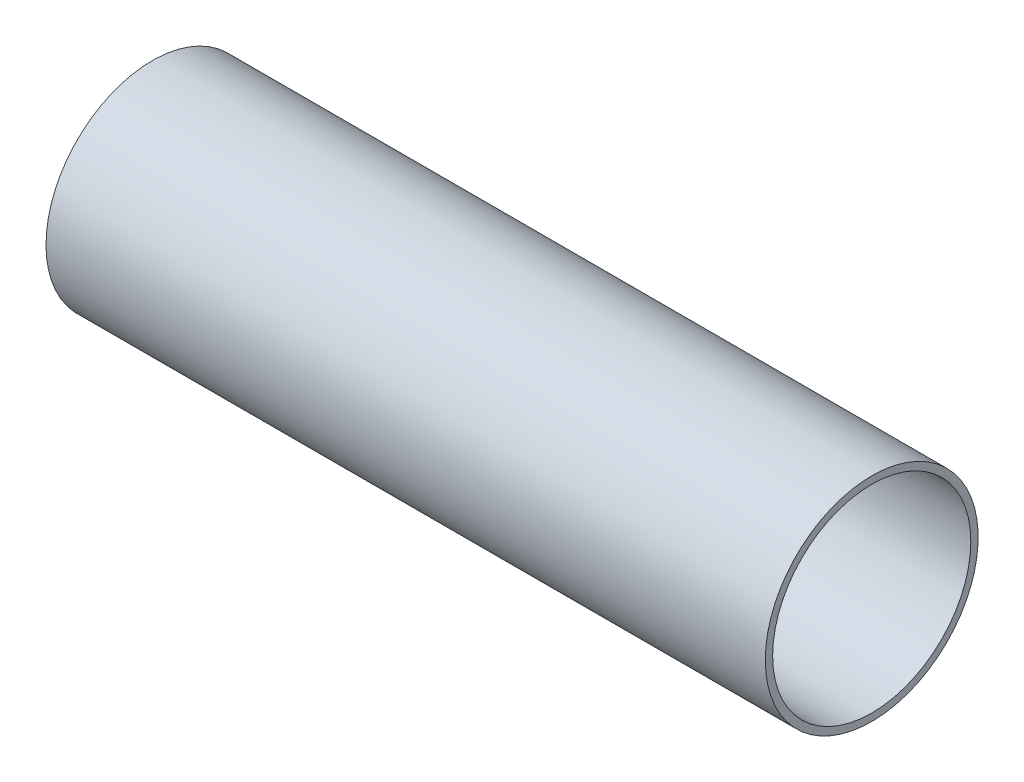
from build123d import *

# Parameters (mm, degrees)
ESQUISSE1_W = 196
ESQUISSE1_H = 2


with BuildPart() as part:
    # Esquisse1 → R_volution1 (revolve)
    with BuildSketch(Plane.XY, mode=Mode.PRIVATE) as r_volution1_sk:
        with Locations((98, 28)):
            Rectangle(ESQUISSE1_W, ESQUISSE1_H)
    revolve(r_volution1_sk.sketch.rotate(Axis((-5.273433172, 0, 0), (1, 0, 0)), 90), axis=Axis((-5.273433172, 0, 0), (1, 0, 0)))


solid = part.part
